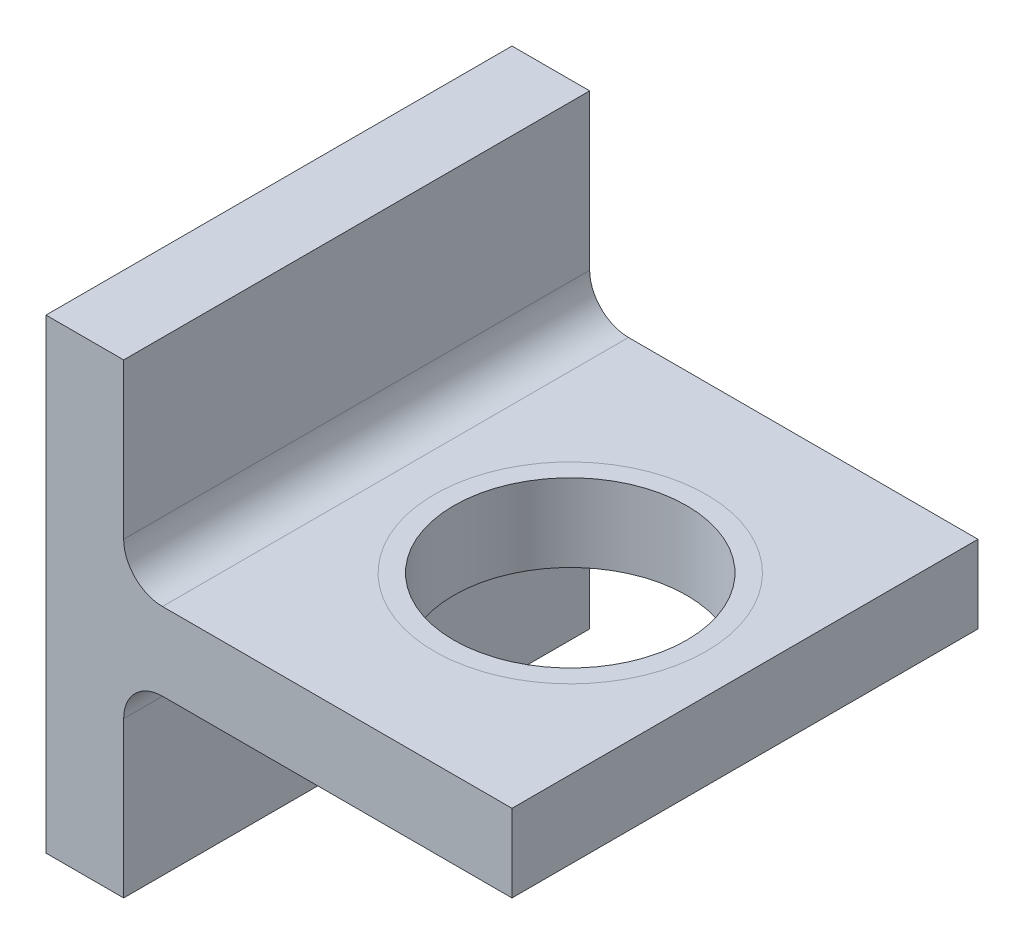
from build123d import *

# Parameters (mm, degrees)
BASE_EXTRUDE_DEPTH  = 120
FILLET1_R           = 10
EXTRUDE1_DEPTH      = 181
EXTRUDE1_DEPTH_BACK = 181
SKETCH2_R           = 30


with BuildPart() as part:
    # Sketch1 → Base-Extrude (new body)
    with BuildSketch(Plane.XY):
        Polygon((0, -60), (20, -60), (20, -10), (120, -10), (120, 10), (20, 10), (20, 60), (0, 60), align=None)
    extrude(amount=BASE_EXTRUDE_DEPTH)

    # Fillet1
    fillet1_edges = [part.edges().sort_by_distance(p)[0] for p in [
        (20, 10, 60),
        (20, -10, 60),
    ]]
    fillet(fillet1_edges, radius=FILLET1_R)

    # Sketch2 → Extrude1 (cut, two sides: drawn at the far end of the back side and taken through both)
    with BuildSketch(Plane(origin=(0, 0, 0), x_dir=(-1, 0, 0), z_dir=(0, 1, 0)).offset(-EXTRUDE1_DEPTH_BACK)):
        with Locations(Location((-75, 60, 0), (0, 0, 90))):
            Circle(SKETCH2_R)
    extrude(amount=EXTRUDE1_DEPTH + EXTRUDE1_DEPTH_BACK, mode=Mode.SUBTRACT)


solid = part.part
